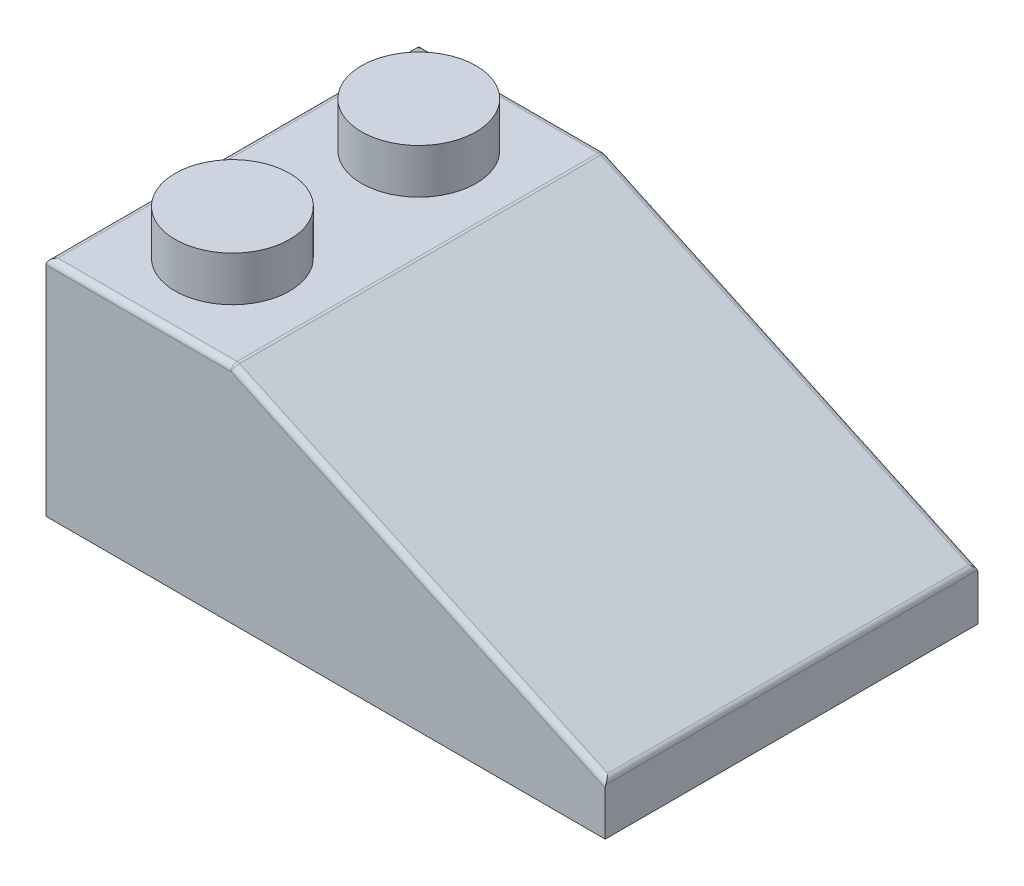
from build123d import *

# Parameters (mm, degrees)
SKETCH1_W            = 23.8125
SKETCH1_H            = 15.875
BASE_EXTRUDE_DEPTH   = 9.525
SKETCH2_R            = 2.4384
BOSS_EXTRUDE1_DEPTH  = 1.905
LPATTERN4_COUNT      = 3
LPATTERN4_PITCH      = 7.9375
LPATTERN4_COUNT_DIR2 = 2
LPATTERN4_PITCH_DIR2 = 7.9375
CUT_EXTRUDE1_DEPTH   = 23.900203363
SHELL1_T             = -1.5875
INSDOT_REACH         = 20.314
SKETCH3_R            = 3.2004
SKETCH3_R_2          = 2.4384
LPATTERN5_COUNT      = 2
LPATTERN5_PITCH      = 7.9375
FILLET1_R            = 0.254


with BuildPart() as part:
    # Sketch1 → Base-Extrude (new body)
    with BuildSketch(Plane(origin=(0, 0, 0), x_dir=(1, 0, 0), z_dir=(0, 1, 0))):
        Rectangle(SKETCH1_W, SKETCH1_H)
    extrude(amount=BASE_EXTRUDE_DEPTH)

    # Sketch2 → Boss-Extrude1 (add)
    with BuildSketch(Plane(origin=(0, 9.525, 0), x_dir=(-1, 0, 0), z_dir=(0, 1, 0))):
        with Locations(Location((7.9375, 3.96875, 0), (0, 0, 270))):
            Circle(SKETCH2_R)
    boss_extrude1 = extrude(amount=BOSS_EXTRUDE1_DEPTH)

    # LPattern4: Boss-Extrude1 3 × 2
    with Locations(*[(i * LPATTERN4_PITCH, 0, -j * LPATTERN4_PITCH_DIR2) for i in range(LPATTERN4_COUNT) for j in range(LPATTERN4_COUNT_DIR2) if (i, j) != (0, 0)]):
        add(boss_extrude1)

    # Sketch4 → Cut-Extrude1 (cut, through all)
    with BuildSketch(Plane.XY.offset(7.9375)):
        Polygon((-3.96875, 9.525), (11.90625, 2.159), (11.90625, 11.43), (-3.96875, 11.43), align=None)
    extrude(amount=-CUT_EXTRUDE1_DEPTH, mode=Mode.SUBTRACT)

    # Shell1
    shell1_openings = [part.faces().sort_by_distance(p)[0] for p in [
        (0, 0, 0),
    ]]
    offset(amount=SHELL1_T, openings=shell1_openings, kind=Kind.INTERSECTION)

    # Sketch3 → InsDot (add, up to next)
    with BuildSketch(Plane.XZ, mode=Mode.PRIVATE) as insdot_sk1:
        with Locations((-3.96875, 0)):
            Circle(SKETCH3_R)
        with Locations((-3.96875, 0)):
            Circle(SKETCH3_R_2, mode=Mode.SUBTRACT)
    insdot_tool1 = extrude(insdot_sk1.sketch, amount=-INSDOT_REACH, mode=Mode.PRIVATE) - part.part
    insdot = insdot_tool1.solids().sort_by_distance((-7.078629, 0, 0))[0]
    add(insdot)

    # LPattern5: InsDot; each copy of InsDot runs up to whatever stops it at its own place
    lpattern5_before = part.part  # the part as the pattern finds it: every copy runs up to it
    lpattern5_insdot_long = extrude(insdot_sk1.sketch, amount=-INSDOT_REACH, mode=Mode.PRIVATE)
    lpattern5_insdot_tool1 = lpattern5_insdot_long.moved(Location(Vector(1, 0, 0) * (1 * LPATTERN5_PITCH))) - lpattern5_before
    add(lpattern5_insdot_tool1.solids().sort_by_distance((0.858871, 0, 0))[0])

    # Fillet1
    fillet1_edges = [part.edges().sort_by_distance(p)[0] for p in [
        (-7.9375, 9.525, -7.9375),
        (-7.9375, 9.525, 7.9375),
        (3.96875, 5.842, 7.9375),
        (-3.96875, 9.525, 0),
        (3.96875, 5.842, -7.9375),
        (11.90625, 2.159, 0),
        (-11.90625, 9.525, 0),
    ]]
    fillet(fillet1_edges, radius=FILLET1_R)


solid = part.part
